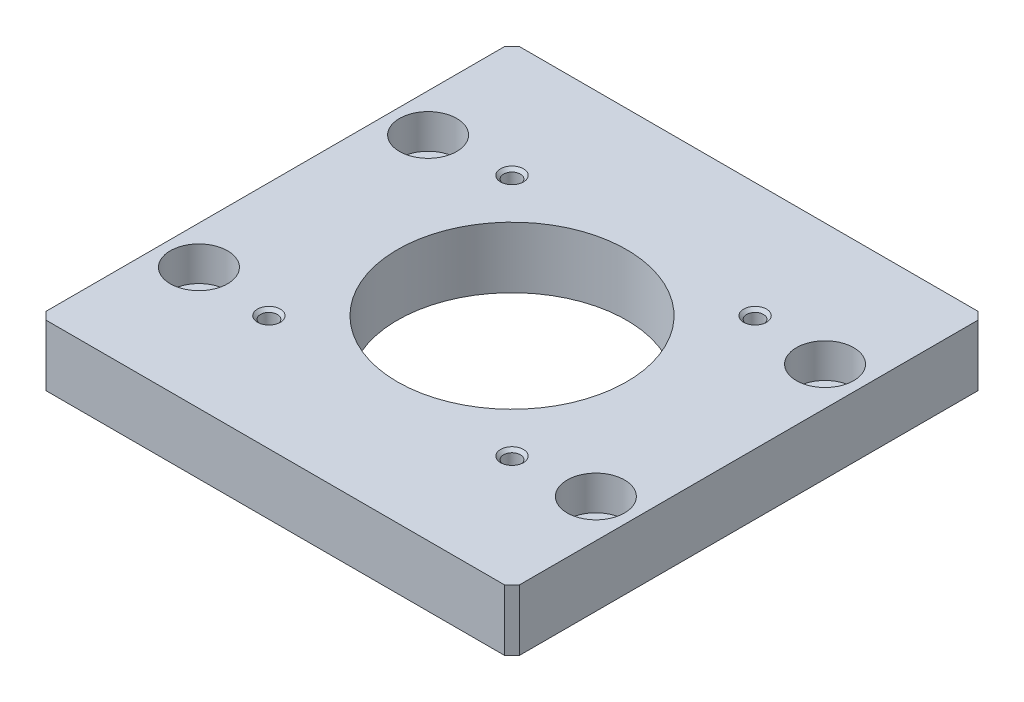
ISO-10303-21;
HEADER;
FILE_DESCRIPTION(('STEP AP214'),'2;1');
FILE_NAME('part.step','',(''),(''),'','','');
FILE_SCHEMA(('AUTOMOTIVE_DESIGN { 1 0 10303 214 1 1 1 1 }'));
ENDSEC;
DATA;
#1=APPLICATION_CONTEXT('core data for automotive mechanical design processes');
#2=APPLICATION_PROTOCOL_DEFINITION('international standard','automotive_design',2000,#1);
#3=PRODUCT_CONTEXT('',#1,'mechanical');
#4=PRODUCT('Part','Part','',(#3));
#5=PRODUCT_RELATED_PRODUCT_CATEGORY('part','',(#4));
#6=PRODUCT_DEFINITION_FORMATION('','',#4);
#7=PRODUCT_DEFINITION_CONTEXT('part definition',#1,'design');
#8=PRODUCT_DEFINITION('design','',#6,#7);
#9=PRODUCT_DEFINITION_SHAPE('','',#8);
#10=(LENGTH_UNIT() NAMED_UNIT(*) SI_UNIT(.MILLI.,.METRE.));
#11=(NAMED_UNIT(*) PLANE_ANGLE_UNIT() SI_UNIT($,.RADIAN.));
#12=(NAMED_UNIT(*) SI_UNIT($,.STERADIAN.) SOLID_ANGLE_UNIT());
#13=UNCERTAINTY_MEASURE_WITH_UNIT(LENGTH_MEASURE(1.E-05),#10,'distance_accuracy_value','');
#14=(GEOMETRIC_REPRESENTATION_CONTEXT(3) GLOBAL_UNCERTAINTY_ASSIGNED_CONTEXT((#13)) GLOBAL_UNIT_ASSIGNED_CONTEXT((#10,
#11,#12)) REPRESENTATION_CONTEXT('',''));
#15=CARTESIAN_POINT('',(0.,0.,0.));
#16=DIRECTION('',(0.,0.,1.));
#17=DIRECTION('',(1.,0.,0.));
#18=AXIS2_PLACEMENT_3D('',#15,#16,#17);
#19=CARTESIAN_POINT('',(-15.9099025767,7.60000000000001,-15.9099025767));
#20=DIRECTION('',(0.,1.,0.));
#21=DIRECTION('',(0.,0.,1.));
#22=AXIS2_PLACEMENT_3D('',#19,#20,#21);
#23=CONICAL_SURFACE('',#22,1.09999999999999,0.78539816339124);
#24=CARTESIAN_POINT('',(-15.9099025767,7.6,-15.9099025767));
#25=DIRECTION('',(0.,1.,0.));
#26=DIRECTION('',(1.,0.,0.));
#27=AXIS2_PLACEMENT_3D('',#24,#25,#26);
#28=CIRCLE('',#27,1.1);
#29=CARTESIAN_POINT('',(-14.8099025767,7.6,-15.9099025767));
#30=VERTEX_POINT('',#29);
#31=EDGE_CURVE('E191',#30,#30,#28,.F.);
#32=ORIENTED_EDGE('',*,*,#31,.T.);
#33=EDGE_LOOP('',(#32));
#34=FACE_BOUND('',#33,.T.);
#35=CARTESIAN_POINT('',(-15.9099025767,8.00000000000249,-15.9099025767));
#36=DIRECTION('',(0.,1.,0.));
#37=DIRECTION('',(0.,0.,1.));
#38=AXIS2_PLACEMENT_3D('',#35,#36,#37);
#39=CIRCLE('',#38,1.49999999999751);
#40=CARTESIAN_POINT('',(-15.9099025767,8.00000000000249,-14.4099025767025));
#41=VERTEX_POINT('',#40);
#42=EDGE_CURVE('E174',#41,#41,#39,.T.);
#43=ORIENTED_EDGE('',*,*,#42,.T.);
#44=EDGE_LOOP('',(#43));
#45=FACE_BOUND('',#44,.T.);
#46=ADVANCED_FACE('F16',(#34,#45),#23,.F.);
#47=CARTESIAN_POINT('',(15.9099025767,7.6,-15.9099025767));
#48=DIRECTION('',(0.,1.,0.));
#49=DIRECTION('',(-1.,0.,0.));
#50=AXIS2_PLACEMENT_3D('',#47,#48,#49);
#51=CONICAL_SURFACE('',#50,1.09999999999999,0.78539816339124);
#52=CARTESIAN_POINT('',(15.9099025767,7.6,-15.9099025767));
#53=DIRECTION('',(0.,1.,0.));
#54=DIRECTION('',(1.,0.,0.));
#55=AXIS2_PLACEMENT_3D('',#52,#53,#54);
#56=CIRCLE('',#55,1.1);
#57=CARTESIAN_POINT('',(17.0099025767,7.6,-15.9099025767));
#58=VERTEX_POINT('',#57);
#59=EDGE_CURVE('E195',#58,#58,#56,.F.);
#60=ORIENTED_EDGE('',*,*,#59,.T.);
#61=EDGE_LOOP('',(#60));
#62=FACE_BOUND('',#61,.T.);
#63=CARTESIAN_POINT('',(15.9099025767,8.00000000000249,-15.9099025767));
#64=DIRECTION('',(0.,1.,0.));
#65=DIRECTION('',(-1.,0.,0.));
#66=AXIS2_PLACEMENT_3D('',#63,#64,#65);
#67=CIRCLE('',#66,1.49999999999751);
#68=CARTESIAN_POINT('',(14.4099025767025,8.00000000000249,-15.9099025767));
#69=VERTEX_POINT('',#68);
#70=EDGE_CURVE('E171',#69,#69,#67,.T.);
#71=ORIENTED_EDGE('',*,*,#70,.T.);
#72=EDGE_LOOP('',(#71));
#73=FACE_BOUND('',#72,.T.);
#74=ADVANCED_FACE('F359',(#62,#73),#51,.F.);
#75=CARTESIAN_POINT('',(-15.9099025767,7.59999999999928,15.9099025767));
#76=DIRECTION('',(0.,1.,0.));
#77=DIRECTION('',(0.,0.,1.));
#78=AXIS2_PLACEMENT_3D('',#75,#76,#77);
#79=CONICAL_SURFACE('',#78,1.10000000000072,0.785398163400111);
#80=CARTESIAN_POINT('',(-15.9099025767,7.6,15.9099025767));
#81=DIRECTION('',(0.,1.,0.));
#82=DIRECTION('',(1.,0.,0.));
#83=AXIS2_PLACEMENT_3D('',#80,#81,#82);
#84=CIRCLE('',#83,1.1);
#85=CARTESIAN_POINT('',(-14.8099025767,7.6,15.9099025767));
#86=VERTEX_POINT('',#85);
#87=EDGE_CURVE('E208',#86,#86,#84,.F.);
#88=ORIENTED_EDGE('',*,*,#87,.T.);
#89=EDGE_LOOP('',(#88));
#90=FACE_BOUND('',#89,.T.);
#91=CARTESIAN_POINT('',(-15.9099025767,7.99999999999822,15.9099025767));
#92=DIRECTION('',(0.,1.,0.));
#93=DIRECTION('',(0.,0.,1.));
#94=AXIS2_PLACEMENT_3D('',#91,#92,#93);
#95=CIRCLE('',#94,1.50000000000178);
#96=CARTESIAN_POINT('',(-15.9099025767,7.99999999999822,17.4099025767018));
#97=VERTEX_POINT('',#96);
#98=EDGE_CURVE('E168',#97,#97,#95,.T.);
#99=ORIENTED_EDGE('',*,*,#98,.T.);
#100=EDGE_LOOP('',(#99));
#101=FACE_BOUND('',#100,.T.);
#102=ADVANCED_FACE('F355',(#90,#101),#79,.F.);
#103=CARTESIAN_POINT('',(15.9099025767,7.59999999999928,15.9099025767));
#104=DIRECTION('',(0.,1.,0.));
#105=DIRECTION('',(-1.,0.,0.));
#106=AXIS2_PLACEMENT_3D('',#103,#104,#105);
#107=CONICAL_SURFACE('',#106,1.10000000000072,0.785398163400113);
#108=CARTESIAN_POINT('',(15.9099025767,7.6,15.9099025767));
#109=DIRECTION('',(0.,1.,0.));
#110=DIRECTION('',(1.,0.,0.));
#111=AXIS2_PLACEMENT_3D('',#108,#109,#110);
#112=CIRCLE('',#111,1.1);
#113=CARTESIAN_POINT('',(17.0099025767,7.6,15.9099025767));
#114=VERTEX_POINT('',#113);
#115=EDGE_CURVE('E200',#114,#114,#112,.F.);
#116=ORIENTED_EDGE('',*,*,#115,.T.);
#117=EDGE_LOOP('',(#116));
#118=FACE_BOUND('',#117,.T.);
#119=CARTESIAN_POINT('',(15.9099025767,7.99999999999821,15.9099025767));
#120=DIRECTION('',(0.,1.,0.));
#121=DIRECTION('',(-1.,0.,0.));
#122=AXIS2_PLACEMENT_3D('',#119,#120,#121);
#123=CIRCLE('',#122,1.50000000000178);
#124=CARTESIAN_POINT('',(14.4099025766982,7.99999999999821,15.9099025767));
#125=VERTEX_POINT('',#124);
#126=EDGE_CURVE('E165',#125,#125,#123,.T.);
#127=ORIENTED_EDGE('',*,*,#126,.T.);
#128=EDGE_LOOP('',(#127));
#129=FACE_BOUND('',#128,.T.);
#130=ADVANCED_FACE('F352',(#118,#129),#107,.F.);
#131=CARTESIAN_POINT('',(25.98076211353,3.5,-15.));
#132=DIRECTION('',(0.,1.,0.));
#133=DIRECTION('',(0.,0.,1.));
#134=AXIS2_PLACEMENT_3D('',#131,#132,#133);
#135=CYLINDRICAL_SURFACE('',#134,3.75);
#136=CARTESIAN_POINT('',(25.98076211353,3.5,-15.));
#137=DIRECTION('',(0.,1.,0.));
#138=DIRECTION('',(0.,0.,1.));
#139=AXIS2_PLACEMENT_3D('',#136,#137,#138);
#140=CIRCLE('',#139,3.75);
#141=CARTESIAN_POINT('',(25.98076211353,3.5,-11.25));
#142=VERTEX_POINT('',#141);
#143=EDGE_CURVE('E20',#142,#142,#140,.F.);
#144=ORIENTED_EDGE('',*,*,#143,.T.);
#145=EDGE_LOOP('',(#144));
#146=FACE_BOUND('',#145,.T.);
#147=CARTESIAN_POINT('',(25.98076211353,8.,-15.));
#148=DIRECTION('',(0.,1.,0.));
#149=DIRECTION('',(0.,0.,1.));
#150=AXIS2_PLACEMENT_3D('',#147,#148,#149);
#151=CIRCLE('',#150,3.75);
#152=CARTESIAN_POINT('',(25.98076211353,8.,-11.25));
#153=VERTEX_POINT('',#152);
#154=EDGE_CURVE('E162',#153,#153,#151,.T.);
#155=ORIENTED_EDGE('',*,*,#154,.T.);
#156=EDGE_LOOP('',(#155));
#157=FACE_BOUND('',#156,.T.);
#158=ADVANCED_FACE('F348',(#146,#157),#135,.F.);
#159=CARTESIAN_POINT('',(-25.98076211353,3.5,-15.));
#160=DIRECTION('',(0.,1.,0.));
#161=DIRECTION('',(0.,0.,1.));
#162=AXIS2_PLACEMENT_3D('',#159,#160,#161);
#163=CYLINDRICAL_SURFACE('',#162,3.75);
#164=CARTESIAN_POINT('',(-25.98076211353,3.5,-15.));
#165=DIRECTION('',(0.,1.,0.));
#166=DIRECTION('',(0.,0.,1.));
#167=AXIS2_PLACEMENT_3D('',#164,#165,#166);
#168=CIRCLE('',#167,3.75);
#169=CARTESIAN_POINT('',(-25.98076211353,3.5,-11.25));
#170=VERTEX_POINT('',#169);
#171=EDGE_CURVE('E184',#170,#170,#168,.F.);
#172=ORIENTED_EDGE('',*,*,#171,.T.);
#173=EDGE_LOOP('',(#172));
#174=FACE_BOUND('',#173,.T.);
#175=CARTESIAN_POINT('',(-25.98076211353,8.,-15.));
#176=DIRECTION('',(0.,1.,0.));
#177=DIRECTION('',(0.,0.,1.));
#178=AXIS2_PLACEMENT_3D('',#175,#176,#177);
#179=CIRCLE('',#178,3.75);
#180=CARTESIAN_POINT('',(-25.98076211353,8.,-11.25));
#181=VERTEX_POINT('',#180);
#182=EDGE_CURVE('E159',#181,#181,#179,.T.);
#183=ORIENTED_EDGE('',*,*,#182,.T.);
#184=EDGE_LOOP('',(#183));
#185=FACE_BOUND('',#184,.T.);
#186=ADVANCED_FACE('F344',(#174,#185),#163,.F.);
#187=CARTESIAN_POINT('',(-25.98076211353,3.5,15.));
#188=DIRECTION('',(0.,1.,0.));
#189=DIRECTION('',(0.,0.,1.));
#190=AXIS2_PLACEMENT_3D('',#187,#188,#189);
#191=CYLINDRICAL_SURFACE('',#190,3.75);
#192=CARTESIAN_POINT('',(-25.98076211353,3.5,15.));
#193=DIRECTION('',(0.,1.,0.));
#194=DIRECTION('',(0.,0.,1.));
#195=AXIS2_PLACEMENT_3D('',#192,#193,#194);
#196=CIRCLE('',#195,3.75);
#197=CARTESIAN_POINT('',(-25.98076211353,3.5,18.75));
#198=VERTEX_POINT('',#197);
#199=EDGE_CURVE('E90',#198,#198,#196,.F.);
#200=ORIENTED_EDGE('',*,*,#199,.T.);
#201=EDGE_LOOP('',(#200));
#202=FACE_BOUND('',#201,.T.);
#203=CARTESIAN_POINT('',(-25.98076211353,8.,15.));
#204=DIRECTION('',(0.,1.,0.));
#205=DIRECTION('',(0.,0.,1.));
#206=AXIS2_PLACEMENT_3D('',#203,#204,#205);
#207=CIRCLE('',#206,3.75);
#208=CARTESIAN_POINT('',(-25.98076211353,8.,18.75));
#209=VERTEX_POINT('',#208);
#210=EDGE_CURVE('E107',#209,#209,#207,.T.);
#211=ORIENTED_EDGE('',*,*,#210,.T.);
#212=EDGE_LOOP('',(#211));
#213=FACE_BOUND('',#212,.T.);
#214=ADVANCED_FACE('F341',(#202,#213),#191,.F.);
#215=CARTESIAN_POINT('',(25.98076211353,3.5,15.));
#216=DIRECTION('',(0.,1.,0.));
#217=DIRECTION('',(0.,0.,1.));
#218=AXIS2_PLACEMENT_3D('',#215,#216,#217);
#219=CYLINDRICAL_SURFACE('',#218,3.75);
#220=CARTESIAN_POINT('',(25.98076211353,3.5,15.));
#221=DIRECTION('',(0.,1.,0.));
#222=DIRECTION('',(0.,0.,1.));
#223=AXIS2_PLACEMENT_3D('',#220,#221,#222);
#224=CIRCLE('',#223,3.75);
#225=CARTESIAN_POINT('',(25.98076211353,3.5,18.75));
#226=VERTEX_POINT('',#225);
#227=EDGE_CURVE('E186',#226,#226,#224,.F.);
#228=ORIENTED_EDGE('',*,*,#227,.T.);
#229=EDGE_LOOP('',(#228));
#230=FACE_BOUND('',#229,.T.);
#231=CARTESIAN_POINT('',(25.98076211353,8.,15.));
#232=DIRECTION('',(0.,1.,0.));
#233=DIRECTION('',(0.,0.,1.));
#234=AXIS2_PLACEMENT_3D('',#231,#232,#233);
#235=CIRCLE('',#234,3.75);
#236=CARTESIAN_POINT('',(25.98076211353,8.,18.75));
#237=VERTEX_POINT('',#236);
#238=EDGE_CURVE('E104',#237,#237,#235,.T.);
#239=ORIENTED_EDGE('',*,*,#238,.T.);
#240=EDGE_LOOP('',(#239));
#241=FACE_BOUND('',#240,.T.);
#242=ADVANCED_FACE('F338',(#230,#241),#219,.F.);
#243=CARTESIAN_POINT('',(-31.08184,8.16,-29.91816));
#244=DIRECTION('',(-0.707106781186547,0.,-0.707106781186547));
#245=DIRECTION('',(0.707106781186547,0.,-0.707106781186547));
#246=AXIS2_PLACEMENT_3D('',#243,#244,#245);
#247=PLANE('',#246);
#248=DIRECTION('',(0.707106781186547,0.,-0.707106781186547));
#249=VECTOR('',#248,1.);
#250=CARTESIAN_POINT('',(-31.08184,8.,-29.91816));
#251=LINE('',#250,#249);
#252=CARTESIAN_POINT('',(-31.,8.,-30.));
#253=VERTEX_POINT('',#252);
#254=CARTESIAN_POINT('',(-30.,8.,-31.));
#255=VERTEX_POINT('',#254);
#256=EDGE_CURVE('E177',#253,#255,#251,.T.);
#257=ORIENTED_EDGE('',*,*,#256,.T.);
#258=DIRECTION('',(0.,1.,0.));
#259=VECTOR('',#258,1.);
#260=CARTESIAN_POINT('',(-30.,4.,-31.));
#261=LINE('',#260,#259);
#262=CARTESIAN_POINT('',(-30.,0.,-31.));
#263=VERTEX_POINT('',#262);
#264=EDGE_CURVE('E100',#255,#263,#261,.F.);
#265=ORIENTED_EDGE('',*,*,#264,.T.);
#266=DIRECTION('',(-0.707106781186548,0.,0.707106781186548));
#267=VECTOR('',#266,1.);
#268=CARTESIAN_POINT('',(-30.5,0.,-30.5));
#269=LINE('',#268,#267);
#270=CARTESIAN_POINT('',(-31.,0.,-30.));
#271=VERTEX_POINT('',#270);
#272=EDGE_CURVE('E203',#271,#263,#269,.F.);
#273=ORIENTED_EDGE('',*,*,#272,.F.);
#274=DIRECTION('',(0.,-1.,0.));
#275=VECTOR('',#274,1.);
#276=CARTESIAN_POINT('',(-31.,4.,-30.));
#277=LINE('',#276,#275);
#278=EDGE_CURVE('E215',#271,#253,#277,.F.);
#279=ORIENTED_EDGE('',*,*,#278,.T.);
#280=EDGE_LOOP('',(#257,#265,#273,#279));
#281=FACE_BOUND('',#280,.T.);
#282=ADVANCED_FACE('F261',(#281),#247,.T.);
#283=CARTESIAN_POINT('',(-29.91816,8.16,31.08184));
#284=DIRECTION('',(-0.707106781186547,0.,0.707106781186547));
#285=DIRECTION('',(-0.707106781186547,0.,-0.707106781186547));
#286=AXIS2_PLACEMENT_3D('',#283,#284,#285);
#287=PLANE('',#286);
#288=DIRECTION('',(-0.707106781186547,0.,-0.707106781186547));
#289=VECTOR('',#288,1.);
#290=CARTESIAN_POINT('',(-29.91816,8.,31.08184));
#291=LINE('',#290,#289);
#292=CARTESIAN_POINT('',(-30.,8.,31.));
#293=VERTEX_POINT('',#292);
#294=CARTESIAN_POINT('',(-31.,8.,30.));
#295=VERTEX_POINT('',#294);
#296=EDGE_CURVE('E179',#293,#295,#291,.T.);
#297=ORIENTED_EDGE('',*,*,#296,.T.);
#298=DIRECTION('',(0.,1.,0.));
#299=VECTOR('',#298,1.);
#300=CARTESIAN_POINT('',(-31.,4.,30.));
#301=LINE('',#300,#299);
#302=CARTESIAN_POINT('',(-31.,0.,30.));
#303=VERTEX_POINT('',#302);
#304=EDGE_CURVE('E214',#295,#303,#301,.F.);
#305=ORIENTED_EDGE('',*,*,#304,.T.);
#306=DIRECTION('',(0.707106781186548,0.,0.707106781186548));
#307=VECTOR('',#306,1.);
#308=CARTESIAN_POINT('',(-30.5,0.,30.5));
#309=LINE('',#308,#307);
#310=CARTESIAN_POINT('',(-30.,0.,31.));
#311=VERTEX_POINT('',#310);
#312=EDGE_CURVE('E257',#311,#303,#309,.F.);
#313=ORIENTED_EDGE('',*,*,#312,.F.);
#314=DIRECTION('',(0.,-1.,0.));
#315=VECTOR('',#314,1.);
#316=CARTESIAN_POINT('',(-30.,4.,31.));
#317=LINE('',#316,#315);
#318=EDGE_CURVE('E222',#311,#293,#317,.F.);
#319=ORIENTED_EDGE('',*,*,#318,.T.);
#320=EDGE_LOOP('',(#297,#305,#313,#319));
#321=FACE_BOUND('',#320,.T.);
#322=ADVANCED_FACE('F267',(#321),#287,.T.);
#323=CARTESIAN_POINT('',(29.91816,8.16,-31.08184));
#324=DIRECTION('',(0.707106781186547,0.,-0.707106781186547));
#325=DIRECTION('',(0.707106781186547,0.,0.707106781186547));
#326=AXIS2_PLACEMENT_3D('',#323,#324,#325);
#327=PLANE('',#326);
#328=DIRECTION('',(0.707106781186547,0.,0.707106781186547));
#329=VECTOR('',#328,1.);
#330=CARTESIAN_POINT('',(29.91816,8.,-31.08184));
#331=LINE('',#330,#329);
#332=CARTESIAN_POINT('',(30.,8.,-31.));
#333=VERTEX_POINT('',#332);
#334=CARTESIAN_POINT('',(31.,8.,-30.));
#335=VERTEX_POINT('',#334);
#336=EDGE_CURVE('E80',#333,#335,#331,.T.);
#337=ORIENTED_EDGE('',*,*,#336,.T.);
#338=DIRECTION('',(0.,1.,0.));
#339=VECTOR('',#338,1.);
#340=CARTESIAN_POINT('',(31.,4.,-30.));
#341=LINE('',#340,#339);
#342=CARTESIAN_POINT('',(31.,0.,-30.));
#343=VERTEX_POINT('',#342);
#344=EDGE_CURVE('E113',#335,#343,#341,.F.);
#345=ORIENTED_EDGE('',*,*,#344,.T.);
#346=DIRECTION('',(-0.707106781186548,0.,-0.707106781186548));
#347=VECTOR('',#346,1.);
#348=CARTESIAN_POINT('',(30.5,0.,-30.5));
#349=LINE('',#348,#347);
#350=CARTESIAN_POINT('',(30.,0.,-31.));
#351=VERTEX_POINT('',#350);
#352=EDGE_CURVE('E103',#351,#343,#349,.F.);
#353=ORIENTED_EDGE('',*,*,#352,.F.);
#354=DIRECTION('',(0.,-1.,0.));
#355=VECTOR('',#354,1.);
#356=CARTESIAN_POINT('',(30.,4.,-31.));
#357=LINE('',#356,#355);
#358=EDGE_CURVE('E97',#351,#333,#357,.F.);
#359=ORIENTED_EDGE('',*,*,#358,.T.);
#360=EDGE_LOOP('',(#337,#345,#353,#359));
#361=FACE_BOUND('',#360,.T.);
#362=ADVANCED_FACE('F102',(#361),#327,.T.);
#363=CARTESIAN_POINT('',(31.08184,8.16,29.91816));
#364=DIRECTION('',(0.707106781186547,0.,0.707106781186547));
#365=DIRECTION('',(-0.707106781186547,0.,0.707106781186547));
#366=AXIS2_PLACEMENT_3D('',#363,#364,#365);
#367=PLANE('',#366);
#368=DIRECTION('',(-0.707106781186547,0.,0.707106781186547));
#369=VECTOR('',#368,1.);
#370=CARTESIAN_POINT('',(31.08184,8.,29.91816));
#371=LINE('',#370,#369);
#372=CARTESIAN_POINT('',(31.,8.,30.));
#373=VERTEX_POINT('',#372);
#374=CARTESIAN_POINT('',(30.,8.,31.));
#375=VERTEX_POINT('',#374);
#376=EDGE_CURVE('E89',#373,#375,#371,.T.);
#377=ORIENTED_EDGE('',*,*,#376,.T.);
#378=DIRECTION('',(0.,1.,0.));
#379=VECTOR('',#378,1.);
#380=CARTESIAN_POINT('',(30.,4.,31.));
#381=LINE('',#380,#379);
#382=CARTESIAN_POINT('',(30.,0.,31.));
#383=VERTEX_POINT('',#382);
#384=EDGE_CURVE('E111',#375,#383,#381,.F.);
#385=ORIENTED_EDGE('',*,*,#384,.T.);
#386=DIRECTION('',(0.707106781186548,0.,-0.707106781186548));
#387=VECTOR('',#386,1.);
#388=CARTESIAN_POINT('',(30.5,0.,30.5));
#389=LINE('',#388,#387);
#390=CARTESIAN_POINT('',(31.,0.,30.));
#391=VERTEX_POINT('',#390);
#392=EDGE_CURVE('E35',#391,#383,#389,.F.);
#393=ORIENTED_EDGE('',*,*,#392,.F.);
#394=DIRECTION('',(0.,-1.,0.));
#395=VECTOR('',#394,1.);
#396=CARTESIAN_POINT('',(31.,4.,30.));
#397=LINE('',#396,#395);
#398=EDGE_CURVE('E114',#391,#373,#397,.F.);
#399=ORIENTED_EDGE('',*,*,#398,.T.);
#400=EDGE_LOOP('',(#377,#385,#393,#399));
#401=FACE_BOUND('',#400,.T.);
#402=ADVANCED_FACE('F228',(#401),#367,.T.);
#403=CARTESIAN_POINT('',(-15.9099025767,0.4,15.9099025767));
#404=DIRECTION('',(0.,1.,0.));
#405=DIRECTION('',(0.,0.,1.));
#406=AXIS2_PLACEMENT_3D('',#403,#404,#405);
#407=CYLINDRICAL_SURFACE('',#406,1.1);
#408=CARTESIAN_POINT('',(-15.9099025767,0.400000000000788,15.9099025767));
#409=DIRECTION('',(0.,-1.,0.));
#410=DIRECTION('',(0.,0.,-1.));
#411=AXIS2_PLACEMENT_3D('',#408,#409,#410);
#412=CIRCLE('',#411,1.10000000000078);
#413=CARTESIAN_POINT('',(-15.9099025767,0.400000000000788,14.8099025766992));
#414=VERTEX_POINT('',#413);
#415=EDGE_CURVE('E227',#414,#414,#412,.T.);
#416=ORIENTED_EDGE('',*,*,#415,.T.);
#417=EDGE_LOOP('',(#416));
#418=FACE_BOUND('',#417,.T.);
#419=ORIENTED_EDGE('',*,*,#87,.F.);
#420=EDGE_LOOP('',(#419));
#421=FACE_BOUND('',#420,.T.);
#422=ADVANCED_FACE('F333',(#418,#421),#407,.F.);
#423=CARTESIAN_POINT('',(15.9099025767,0.4,15.9099025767));
#424=DIRECTION('',(0.,1.,0.));
#425=DIRECTION('',(0.,0.,1.));
#426=AXIS2_PLACEMENT_3D('',#423,#424,#425);
#427=CYLINDRICAL_SURFACE('',#426,1.1);
#428=CARTESIAN_POINT('',(15.9099025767,0.400000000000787,15.9099025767));
#429=DIRECTION('',(0.,-1.,0.));
#430=DIRECTION('',(0.,0.,-1.));
#431=AXIS2_PLACEMENT_3D('',#428,#429,#430);
#432=CIRCLE('',#431,1.10000000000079);
#433=CARTESIAN_POINT('',(15.9099025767,0.400000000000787,14.8099025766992));
#434=VERTEX_POINT('',#433);
#435=EDGE_CURVE('E251',#434,#434,#432,.T.);
#436=ORIENTED_EDGE('',*,*,#435,.T.);
#437=EDGE_LOOP('',(#436));
#438=FACE_BOUND('',#437,.T.);
#439=ORIENTED_EDGE('',*,*,#115,.F.);
#440=EDGE_LOOP('',(#439));
#441=FACE_BOUND('',#440,.T.);
#442=ADVANCED_FACE('F329',(#438,#441),#427,.F.);
#443=CARTESIAN_POINT('',(15.9099025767,0.4,-15.9099025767));
#444=DIRECTION('',(0.,1.,0.));
#445=DIRECTION('',(0.,0.,1.));
#446=AXIS2_PLACEMENT_3D('',#443,#444,#445);
#447=CYLINDRICAL_SURFACE('',#446,1.1);
#448=CARTESIAN_POINT('',(15.9099025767,0.400000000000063,-15.9099025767));
#449=DIRECTION('',(0.,-1.,0.));
#450=DIRECTION('',(0.,0.,-1.));
#451=AXIS2_PLACEMENT_3D('',#448,#449,#450);
#452=CIRCLE('',#451,1.10000000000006);
#453=CARTESIAN_POINT('',(15.9099025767,0.400000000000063,-17.0099025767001));
#454=VERTEX_POINT('',#453);
#455=EDGE_CURVE('E248',#454,#454,#452,.T.);
#456=ORIENTED_EDGE('',*,*,#455,.T.);
#457=EDGE_LOOP('',(#456));
#458=FACE_BOUND('',#457,.T.);
#459=ORIENTED_EDGE('',*,*,#59,.F.);
#460=EDGE_LOOP('',(#459));
#461=FACE_BOUND('',#460,.T.);
#462=ADVANCED_FACE('F325',(#458,#461),#447,.F.);
#463=CARTESIAN_POINT('',(-15.9099025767,0.4,-15.9099025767));
#464=DIRECTION('',(0.,1.,0.));
#465=DIRECTION('',(0.,0.,1.));
#466=AXIS2_PLACEMENT_3D('',#463,#464,#465);
#467=CYLINDRICAL_SURFACE('',#466,1.1);
#468=CARTESIAN_POINT('',(-15.9099025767,0.400000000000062,-15.9099025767));
#469=DIRECTION('',(0.,-1.,0.));
#470=DIRECTION('',(0.,0.,-1.));
#471=AXIS2_PLACEMENT_3D('',#468,#469,#470);
#472=CIRCLE('',#471,1.10000000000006);
#473=CARTESIAN_POINT('',(-15.9099025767,0.400000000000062,-17.0099025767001));
#474=VERTEX_POINT('',#473);
#475=EDGE_CURVE('E155',#474,#474,#472,.T.);
#476=ORIENTED_EDGE('',*,*,#475,.T.);
#477=EDGE_LOOP('',(#476));
#478=FACE_BOUND('',#477,.T.);
#479=ORIENTED_EDGE('',*,*,#31,.F.);
#480=EDGE_LOOP('',(#479));
#481=FACE_BOUND('',#480,.T.);
#482=ADVANCED_FACE('F321',(#478,#481),#467,.F.);
#483=CARTESIAN_POINT('',(-30.91999259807,3.5,19.50812731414));
#484=DIRECTION('',(0.,1.,0.));
#485=DIRECTION('',(1.,0.,0.));
#486=AXIS2_PLACEMENT_3D('',#483,#484,#485);
#487=PLANE('',#486);
#488=CARTESIAN_POINT('',(25.98076211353,3.5,-15.));
#489=DIRECTION('',(0.,1.,0.));
#490=DIRECTION('',(0.,0.,1.));
#491=AXIS2_PLACEMENT_3D('',#488,#489,#490);
#492=CIRCLE('',#491,2.25);
#493=CARTESIAN_POINT('',(25.98076211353,3.5,-12.75));
#494=VERTEX_POINT('',#493);
#495=EDGE_CURVE('E153',#494,#494,#492,.F.);
#496=ORIENTED_EDGE('',*,*,#495,.T.);
#497=EDGE_LOOP('',(#496));
#498=FACE_BOUND('',#497,.T.);
#499=ORIENTED_EDGE('',*,*,#143,.F.);
#500=EDGE_LOOP('',(#499));
#501=FACE_BOUND('',#500,.T.);
#502=ADVANCED_FACE('F324',(#498,#501),#487,.T.);
#503=CARTESIAN_POINT('',(-30.91999259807,3.5,19.50812731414));
#504=DIRECTION('',(0.,1.,0.));
#505=DIRECTION('',(1.,0.,0.));
#506=AXIS2_PLACEMENT_3D('',#503,#504,#505);
#507=PLANE('',#506);
#508=CARTESIAN_POINT('',(25.98076211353,3.5,15.));
#509=DIRECTION('',(0.,1.,0.));
#510=DIRECTION('',(0.,0.,1.));
#511=AXIS2_PLACEMENT_3D('',#508,#509,#510);
#512=CIRCLE('',#511,2.25);
#513=CARTESIAN_POINT('',(25.98076211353,3.5,17.25));
#514=VERTEX_POINT('',#513);
#515=EDGE_CURVE('E150',#514,#514,#512,.F.);
#516=ORIENTED_EDGE('',*,*,#515,.T.);
#517=EDGE_LOOP('',(#516));
#518=FACE_BOUND('',#517,.T.);
#519=ORIENTED_EDGE('',*,*,#227,.F.);
#520=EDGE_LOOP('',(#519));
#521=FACE_BOUND('',#520,.T.);
#522=ADVANCED_FACE('F376',(#518,#521),#507,.T.);
#523=CARTESIAN_POINT('',(-30.91999259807,3.5,19.50812731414));
#524=DIRECTION('',(0.,1.,0.));
#525=DIRECTION('',(1.,0.,0.));
#526=AXIS2_PLACEMENT_3D('',#523,#524,#525);
#527=PLANE('',#526);
#528=CARTESIAN_POINT('',(-25.98076211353,3.5,-15.));
#529=DIRECTION('',(0.,1.,0.));
#530=DIRECTION('',(0.,0.,1.));
#531=AXIS2_PLACEMENT_3D('',#528,#529,#530);
#532=CIRCLE('',#531,2.25);
#533=CARTESIAN_POINT('',(-25.98076211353,3.5,-12.75));
#534=VERTEX_POINT('',#533);
#535=EDGE_CURVE('E147',#534,#534,#532,.F.);
#536=ORIENTED_EDGE('',*,*,#535,.T.);
#537=EDGE_LOOP('',(#536));
#538=FACE_BOUND('',#537,.T.);
#539=ORIENTED_EDGE('',*,*,#171,.F.);
#540=EDGE_LOOP('',(#539));
#541=FACE_BOUND('',#540,.T.);
#542=ADVANCED_FACE('F380',(#538,#541),#527,.T.);
#543=CARTESIAN_POINT('',(-30.91999259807,3.5,19.50812731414));
#544=DIRECTION('',(0.,1.,0.));
#545=DIRECTION('',(1.,0.,0.));
#546=AXIS2_PLACEMENT_3D('',#543,#544,#545);
#547=PLANE('',#546);
#548=CARTESIAN_POINT('',(-25.98076211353,3.5,15.));
#549=DIRECTION('',(0.,1.,0.));
#550=DIRECTION('',(0.,0.,1.));
#551=AXIS2_PLACEMENT_3D('',#548,#549,#550);
#552=CIRCLE('',#551,2.25);
#553=CARTESIAN_POINT('',(-25.98076211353,3.5,17.25));
#554=VERTEX_POINT('',#553);
#555=EDGE_CURVE('E144',#554,#554,#552,.F.);
#556=ORIENTED_EDGE('',*,*,#555,.T.);
#557=EDGE_LOOP('',(#556));
#558=FACE_BOUND('',#557,.T.);
#559=ORIENTED_EDGE('',*,*,#199,.F.);
#560=EDGE_LOOP('',(#559));
#561=FACE_BOUND('',#560,.T.);
#562=ADVANCED_FACE('F384',(#558,#561),#547,.T.);
#563=CARTESIAN_POINT('',(-32.24,8.,32.24));
#564=DIRECTION('',(0.,1.,0.));
#565=DIRECTION('',(1.,0.,0.));
#566=AXIS2_PLACEMENT_3D('',#563,#564,#565);
#567=PLANE('',#566);
#568=CARTESIAN_POINT('',(0.,8.,0.));
#569=DIRECTION('',(0.,1.,0.));
#570=DIRECTION('',(0.,0.,1.));
#571=AXIS2_PLACEMENT_3D('',#568,#569,#570);
#572=CIRCLE('',#571,15.);
#573=CARTESIAN_POINT('',(0.,8.,15.));
#574=VERTEX_POINT('',#573);
#575=EDGE_CURVE('E140',#574,#574,#572,.F.);
#576=ORIENTED_EDGE('',*,*,#575,.T.);
#577=EDGE_LOOP('',(#576));
#578=FACE_BOUND('',#577,.T.);
#579=ORIENTED_EDGE('',*,*,#238,.F.);
#580=EDGE_LOOP('',(#579));
#581=FACE_BOUND('',#580,.T.);
#582=ORIENTED_EDGE('',*,*,#210,.F.);
#583=EDGE_LOOP('',(#582));
#584=FACE_BOUND('',#583,.T.);
#585=ORIENTED_EDGE('',*,*,#182,.F.);
#586=EDGE_LOOP('',(#585));
#587=FACE_BOUND('',#586,.T.);
#588=ORIENTED_EDGE('',*,*,#154,.F.);
#589=EDGE_LOOP('',(#588));
#590=FACE_BOUND('',#589,.T.);
#591=ORIENTED_EDGE('',*,*,#126,.F.);
#592=EDGE_LOOP('',(#591));
#593=FACE_BOUND('',#592,.T.);
#594=ORIENTED_EDGE('',*,*,#98,.F.);
#595=EDGE_LOOP('',(#594));
#596=FACE_BOUND('',#595,.T.);
#597=ORIENTED_EDGE('',*,*,#70,.F.);
#598=EDGE_LOOP('',(#597));
#599=FACE_BOUND('',#598,.T.);
#600=ORIENTED_EDGE('',*,*,#42,.F.);
#601=EDGE_LOOP('',(#600));
#602=FACE_BOUND('',#601,.T.);
#603=ORIENTED_EDGE('',*,*,#256,.F.);
#604=DIRECTION('',(0.,0.,-1.));
#605=VECTOR('',#604,1.);
#606=CARTESIAN_POINT('',(-31.,8.,0.));
#607=LINE('',#606,#605);
#608=EDGE_CURVE('E211',#253,#295,#607,.F.);
#609=ORIENTED_EDGE('',*,*,#608,.T.);
#610=ORIENTED_EDGE('',*,*,#296,.F.);
#611=DIRECTION('',(-1.,0.,0.));
#612=VECTOR('',#611,1.);
#613=CARTESIAN_POINT('',(0.,8.,31.));
#614=LINE('',#613,#612);
#615=EDGE_CURVE('E219',#293,#375,#614,.F.);
#616=ORIENTED_EDGE('',*,*,#615,.T.);
#617=ORIENTED_EDGE('',*,*,#376,.F.);
#618=DIRECTION('',(0.,0.,1.));
#619=VECTOR('',#618,1.);
#620=CARTESIAN_POINT('',(31.,8.,0.));
#621=LINE('',#620,#619);
#622=EDGE_CURVE('E85',#373,#335,#621,.F.);
#623=ORIENTED_EDGE('',*,*,#622,.T.);
#624=ORIENTED_EDGE('',*,*,#336,.F.);
#625=DIRECTION('',(1.,0.,0.));
#626=VECTOR('',#625,1.);
#627=CARTESIAN_POINT('',(0.,8.,-31.));
#628=LINE('',#627,#626);
#629=EDGE_CURVE('E83',#333,#255,#628,.F.);
#630=ORIENTED_EDGE('',*,*,#629,.T.);
#631=EDGE_LOOP('',(#603,#609,#610,#616,#617,#623,#624,#630));
#632=FACE_BOUND('',#631,.T.);
#633=ADVANCED_FACE('F82',(#578,#581,#584,#587,#590,#593,#596,#599,#602,#632),#567,.T.);
#634=CARTESIAN_POINT('',(31.2,-0.16,-31.));
#635=DIRECTION('',(0.,0.,-1.));
#636=DIRECTION('',(-1.,0.,0.));
#637=AXIS2_PLACEMENT_3D('',#634,#635,#636);
#638=PLANE('',#637);
#639=ORIENTED_EDGE('',*,*,#264,.F.);
#640=ORIENTED_EDGE('',*,*,#629,.F.);
#641=ORIENTED_EDGE('',*,*,#358,.F.);
#642=DIRECTION('',(-1.,0.,0.));
#643=VECTOR('',#642,1.);
#644=CARTESIAN_POINT('',(0.,0.,-31.));
#645=LINE('',#644,#643);
#646=EDGE_CURVE('E143',#351,#263,#645,.T.);
#647=ORIENTED_EDGE('',*,*,#646,.T.);
#648=EDGE_LOOP('',(#639,#640,#641,#647));
#649=FACE_BOUND('',#648,.T.);
#650=ADVANCED_FACE('F95',(#649),#638,.T.);
#651=CARTESIAN_POINT('',(-31.,-0.16,-31.2));
#652=DIRECTION('',(-1.,0.,0.));
#653=DIRECTION('',(0.,0.,1.));
#654=AXIS2_PLACEMENT_3D('',#651,#652,#653);
#655=PLANE('',#654);
#656=ORIENTED_EDGE('',*,*,#304,.F.);
#657=ORIENTED_EDGE('',*,*,#608,.F.);
#658=ORIENTED_EDGE('',*,*,#278,.F.);
#659=DIRECTION('',(0.,0.,1.));
#660=VECTOR('',#659,1.);
#661=CARTESIAN_POINT('',(-31.,0.,0.));
#662=LINE('',#661,#660);
#663=EDGE_CURVE('E240',#271,#303,#662,.T.);
#664=ORIENTED_EDGE('',*,*,#663,.T.);
#665=EDGE_LOOP('',(#656,#657,#658,#664));
#666=FACE_BOUND('',#665,.T.);
#667=ADVANCED_FACE('F265',(#666),#655,.T.);
#668=CARTESIAN_POINT('',(-31.2,-0.16,31.));
#669=DIRECTION('',(0.,0.,1.));
#670=DIRECTION('',(1.,0.,0.));
#671=AXIS2_PLACEMENT_3D('',#668,#669,#670);
#672=PLANE('',#671);
#673=ORIENTED_EDGE('',*,*,#384,.F.);
#674=ORIENTED_EDGE('',*,*,#615,.F.);
#675=ORIENTED_EDGE('',*,*,#318,.F.);
#676=DIRECTION('',(1.,0.,0.));
#677=VECTOR('',#676,1.);
#678=CARTESIAN_POINT('',(0.,0.,31.));
#679=LINE('',#678,#677);
#680=EDGE_CURVE('E237',#311,#383,#679,.T.);
#681=ORIENTED_EDGE('',*,*,#680,.T.);
#682=EDGE_LOOP('',(#673,#674,#675,#681));
#683=FACE_BOUND('',#682,.T.);
#684=ADVANCED_FACE('F271',(#683),#672,.T.);
#685=CARTESIAN_POINT('',(31.,-0.16,31.2));
#686=DIRECTION('',(1.,0.,0.));
#687=DIRECTION('',(0.,0.,-1.));
#688=AXIS2_PLACEMENT_3D('',#685,#686,#687);
#689=PLANE('',#688);
#690=ORIENTED_EDGE('',*,*,#398,.F.);
#691=DIRECTION('',(0.,0.,-1.));
#692=VECTOR('',#691,1.);
#693=CARTESIAN_POINT('',(31.,0.,0.));
#694=LINE('',#693,#692);
#695=EDGE_CURVE('E139',#391,#343,#694,.T.);
#696=ORIENTED_EDGE('',*,*,#695,.T.);
#697=ORIENTED_EDGE('',*,*,#344,.F.);
#698=ORIENTED_EDGE('',*,*,#622,.F.);
#699=EDGE_LOOP('',(#690,#696,#697,#698));
#700=FACE_BOUND('',#699,.T.);
#701=ADVANCED_FACE('F233',(#700),#689,.T.);
#702=CARTESIAN_POINT('',(-15.9099025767,0.400000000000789,15.9099025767));
#703=DIRECTION('',(0.,-1.,0.));
#704=DIRECTION('',(1.,0.,0.));
#705=AXIS2_PLACEMENT_3D('',#702,#703,#704);
#706=CONICAL_SURFACE('',#705,1.10000000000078,0.785398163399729);
#707=ORIENTED_EDGE('',*,*,#415,.F.);
#708=EDGE_LOOP('',(#707));
#709=FACE_BOUND('',#708,.T.);
#710=CARTESIAN_POINT('',(-15.9099025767,1.69748113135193E-12,15.9099025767));
#711=DIRECTION('',(0.,-1.,0.));
#712=DIRECTION('',(0.,0.,-1.));
#713=AXIS2_PLACEMENT_3D('',#710,#711,#712);
#714=CIRCLE('',#713,1.5000000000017);
#715=CARTESIAN_POINT('',(-15.9099025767,1.69748113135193E-12,14.4099025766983));
#716=VERTEX_POINT('',#715);
#717=EDGE_CURVE('E136',#716,#716,#714,.T.);
#718=ORIENTED_EDGE('',*,*,#717,.T.);
#719=EDGE_LOOP('',(#718));
#720=FACE_BOUND('',#719,.T.);
#721=ADVANCED_FACE('F279',(#709,#720),#706,.F.);
#722=CARTESIAN_POINT('',(15.9099025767,0.40000000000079,15.9099025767));
#723=DIRECTION('',(0.,-1.,0.));
#724=DIRECTION('',(0.,0.,-1.));
#725=AXIS2_PLACEMENT_3D('',#722,#723,#724);
#726=CONICAL_SURFACE('',#725,1.10000000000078,0.78539816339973);
#727=ORIENTED_EDGE('',*,*,#435,.F.);
#728=EDGE_LOOP('',(#727));
#729=FACE_BOUND('',#728,.T.);
#730=CARTESIAN_POINT('',(15.9099025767,1.69970374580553E-12,15.9099025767));
#731=DIRECTION('',(0.,-1.,0.));
#732=DIRECTION('',(1.,0.,0.));
#733=AXIS2_PLACEMENT_3D('',#730,#731,#732);
#734=CIRCLE('',#733,1.5000000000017);
#735=CARTESIAN_POINT('',(17.4099025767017,1.69966678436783E-12,15.9099025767));
#736=VERTEX_POINT('',#735);
#737=EDGE_CURVE('E133',#736,#736,#734,.T.);
#738=ORIENTED_EDGE('',*,*,#737,.T.);
#739=EDGE_LOOP('',(#738));
#740=FACE_BOUND('',#739,.T.);
#741=ADVANCED_FACE('F309',(#729,#740),#726,.F.);
#742=CARTESIAN_POINT('',(15.9099025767,0.400000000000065,-15.9099025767));
#743=DIRECTION('',(0.,-1.,0.));
#744=DIRECTION('',(1.,0.,0.));
#745=AXIS2_PLACEMENT_3D('',#742,#743,#744);
#746=CONICAL_SURFACE('',#745,1.10000000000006,0.78539816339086);
#747=ORIENTED_EDGE('',*,*,#455,.F.);
#748=EDGE_LOOP('',(#747));
#749=FACE_BOUND('',#748,.T.);
#750=CARTESIAN_POINT('',(15.9099025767,-2.57498015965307E-12,-15.9099025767));
#751=DIRECTION('',(0.,-1.,0.));
#752=DIRECTION('',(0.,0.,-1.));
#753=AXIS2_PLACEMENT_3D('',#750,#751,#752);
#754=CIRCLE('',#753,1.49999999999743);
#755=CARTESIAN_POINT('',(15.9099025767,-2.57498015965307E-12,-17.4099025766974));
#756=VERTEX_POINT('',#755);
#757=EDGE_CURVE('E130',#756,#756,#754,.T.);
#758=ORIENTED_EDGE('',*,*,#757,.T.);
#759=EDGE_LOOP('',(#758));
#760=FACE_BOUND('',#759,.T.);
#761=ADVANCED_FACE('F315',(#749,#760),#746,.F.);
#762=CARTESIAN_POINT('',(-15.9099025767,0.400000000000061,-15.9099025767));
#763=DIRECTION('',(0.,-1.,0.));
#764=DIRECTION('',(1.,0.,0.));
#765=AXIS2_PLACEMENT_3D('',#762,#763,#764);
#766=CONICAL_SURFACE('',#765,1.10000000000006,0.785398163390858);
#767=ORIENTED_EDGE('',*,*,#475,.F.);
#768=EDGE_LOOP('',(#767));
#769=FACE_BOUND('',#768,.T.);
#770=CARTESIAN_POINT('',(-15.9099025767,-2.57411279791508E-12,-15.9099025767));
#771=DIRECTION('',(0.,-1.,0.));
#772=DIRECTION('',(0.,0.,-1.));
#773=AXIS2_PLACEMENT_3D('',#770,#771,#772);
#774=CIRCLE('',#773,1.49999999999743);
#775=CARTESIAN_POINT('',(-15.9099025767,-2.57411279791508E-12,-17.4099025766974));
#776=VERTEX_POINT('',#775);
#777=EDGE_CURVE('E127',#776,#776,#774,.T.);
#778=ORIENTED_EDGE('',*,*,#777,.T.);
#779=EDGE_LOOP('',(#778));
#780=FACE_BOUND('',#779,.T.);
#781=ADVANCED_FACE('F435',(#769,#780),#766,.F.);
#782=CARTESIAN_POINT('',(25.98076211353,0.,-15.));
#783=DIRECTION('',(0.,1.,0.));
#784=DIRECTION('',(0.,0.,1.));
#785=AXIS2_PLACEMENT_3D('',#782,#783,#784);
#786=CYLINDRICAL_SURFACE('',#785,2.25);
#787=CARTESIAN_POINT('',(25.98076211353,0.,-15.));
#788=DIRECTION('',(0.,1.,0.));
#789=DIRECTION('',(0.,0.,1.));
#790=AXIS2_PLACEMENT_3D('',#787,#788,#789);
#791=CIRCLE('',#790,2.25);
#792=CARTESIAN_POINT('',(25.98076211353,0.,-12.75));
#793=VERTEX_POINT('',#792);
#794=EDGE_CURVE('E124',#793,#793,#791,.F.);
#795=ORIENTED_EDGE('',*,*,#794,.T.);
#796=EDGE_LOOP('',(#795));
#797=FACE_BOUND('',#796,.T.);
#798=ORIENTED_EDGE('',*,*,#495,.F.);
#799=EDGE_LOOP('',(#798));
#800=FACE_BOUND('',#799,.T.);
#801=ADVANCED_FACE('F444',(#797,#800),#786,.F.);
#802=CARTESIAN_POINT('',(25.98076211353,0.,15.));
#803=DIRECTION('',(0.,1.,0.));
#804=DIRECTION('',(0.,0.,1.));
#805=AXIS2_PLACEMENT_3D('',#802,#803,#804);
#806=CYLINDRICAL_SURFACE('',#805,2.25);
#807=CARTESIAN_POINT('',(25.98076211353,0.,15.));
#808=DIRECTION('',(0.,1.,0.));
#809=DIRECTION('',(0.,0.,1.));
#810=AXIS2_PLACEMENT_3D('',#807,#808,#809);
#811=CIRCLE('',#810,2.25);
#812=CARTESIAN_POINT('',(25.98076211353,0.,17.25));
#813=VERTEX_POINT('',#812);
#814=EDGE_CURVE('E121',#813,#813,#811,.F.);
#815=ORIENTED_EDGE('',*,*,#814,.T.);
#816=EDGE_LOOP('',(#815));
#817=FACE_BOUND('',#816,.T.);
#818=ORIENTED_EDGE('',*,*,#515,.F.);
#819=EDGE_LOOP('',(#818));
#820=FACE_BOUND('',#819,.T.);
#821=ADVANCED_FACE('F454',(#817,#820),#806,.F.);
#822=CARTESIAN_POINT('',(-25.98076211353,0.,-15.));
#823=DIRECTION('',(0.,1.,0.));
#824=DIRECTION('',(0.,0.,1.));
#825=AXIS2_PLACEMENT_3D('',#822,#823,#824);
#826=CYLINDRICAL_SURFACE('',#825,2.25);
#827=CARTESIAN_POINT('',(-25.98076211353,0.,-15.));
#828=DIRECTION('',(0.,1.,0.));
#829=DIRECTION('',(0.,0.,1.));
#830=AXIS2_PLACEMENT_3D('',#827,#828,#829);
#831=CIRCLE('',#830,2.25);
#832=CARTESIAN_POINT('',(-25.98076211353,0.,-12.75));
#833=VERTEX_POINT('',#832);
#834=EDGE_CURVE('E118',#833,#833,#831,.F.);
#835=ORIENTED_EDGE('',*,*,#834,.T.);
#836=EDGE_LOOP('',(#835));
#837=FACE_BOUND('',#836,.T.);
#838=ORIENTED_EDGE('',*,*,#535,.F.);
#839=EDGE_LOOP('',(#838));
#840=FACE_BOUND('',#839,.T.);
#841=ADVANCED_FACE('F464',(#837,#840),#826,.F.);
#842=CARTESIAN_POINT('',(-25.98076211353,0.,15.));
#843=DIRECTION('',(0.,1.,0.));
#844=DIRECTION('',(0.,0.,1.));
#845=AXIS2_PLACEMENT_3D('',#842,#843,#844);
#846=CYLINDRICAL_SURFACE('',#845,2.25);
#847=CARTESIAN_POINT('',(-25.98076211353,0.,15.));
#848=DIRECTION('',(0.,1.,0.));
#849=DIRECTION('',(0.,0.,1.));
#850=AXIS2_PLACEMENT_3D('',#847,#848,#849);
#851=CIRCLE('',#850,2.25);
#852=CARTESIAN_POINT('',(-25.98076211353,0.,17.25));
#853=VERTEX_POINT('',#852);
#854=EDGE_CURVE('E26',#853,#853,#851,.F.);
#855=ORIENTED_EDGE('',*,*,#854,.T.);
#856=EDGE_LOOP('',(#855));
#857=FACE_BOUND('',#856,.T.);
#858=ORIENTED_EDGE('',*,*,#555,.F.);
#859=EDGE_LOOP('',(#858));
#860=FACE_BOUND('',#859,.T.);
#861=ADVANCED_FACE('F287',(#857,#860),#846,.F.);
#862=CARTESIAN_POINT('',(0.,0.,0.));
#863=DIRECTION('',(0.,1.,0.));
#864=DIRECTION('',(0.,0.,1.));
#865=AXIS2_PLACEMENT_3D('',#862,#863,#864);
#866=CYLINDRICAL_SURFACE('',#865,15.);
#867=ORIENTED_EDGE('',*,*,#575,.F.);
#868=EDGE_LOOP('',(#867));
#869=FACE_BOUND('',#868,.T.);
#870=CARTESIAN_POINT('',(0.,0.,0.));
#871=DIRECTION('',(0.,1.,0.));
#872=DIRECTION('',(0.,0.,1.));
#873=AXIS2_PLACEMENT_3D('',#870,#871,#872);
#874=CIRCLE('',#873,15.);
#875=CARTESIAN_POINT('',(0.,0.,15.));
#876=VERTEX_POINT('',#875);
#877=EDGE_CURVE('E10',#876,#876,#874,.F.);
#878=ORIENTED_EDGE('',*,*,#877,.T.);
#879=EDGE_LOOP('',(#878));
#880=FACE_BOUND('',#879,.T.);
#881=ADVANCED_FACE('F282',(#869,#880),#866,.F.);
#882=CARTESIAN_POINT('',(-32.24,0.,32.24));
#883=DIRECTION('',(0.,1.,0.));
#884=DIRECTION('',(1.,0.,0.));
#885=AXIS2_PLACEMENT_3D('',#882,#883,#884);
#886=PLANE('',#885);
#887=ORIENTED_EDGE('',*,*,#877,.F.);
#888=EDGE_LOOP('',(#887));
#889=FACE_BOUND('',#888,.T.);
#890=ORIENTED_EDGE('',*,*,#854,.F.);
#891=EDGE_LOOP('',(#890));
#892=FACE_BOUND('',#891,.T.);
#893=ORIENTED_EDGE('',*,*,#834,.F.);
#894=EDGE_LOOP('',(#893));
#895=FACE_BOUND('',#894,.T.);
#896=ORIENTED_EDGE('',*,*,#814,.F.);
#897=EDGE_LOOP('',(#896));
#898=FACE_BOUND('',#897,.T.);
#899=ORIENTED_EDGE('',*,*,#794,.F.);
#900=EDGE_LOOP('',(#899));
#901=FACE_BOUND('',#900,.T.);
#902=ORIENTED_EDGE('',*,*,#777,.F.);
#903=EDGE_LOOP('',(#902));
#904=FACE_BOUND('',#903,.T.);
#905=ORIENTED_EDGE('',*,*,#757,.F.);
#906=EDGE_LOOP('',(#905));
#907=FACE_BOUND('',#906,.T.);
#908=ORIENTED_EDGE('',*,*,#737,.F.);
#909=EDGE_LOOP('',(#908));
#910=FACE_BOUND('',#909,.T.);
#911=ORIENTED_EDGE('',*,*,#717,.F.);
#912=EDGE_LOOP('',(#911));
#913=FACE_BOUND('',#912,.T.);
#914=ORIENTED_EDGE('',*,*,#392,.T.);
#915=ORIENTED_EDGE('',*,*,#680,.F.);
#916=ORIENTED_EDGE('',*,*,#312,.T.);
#917=ORIENTED_EDGE('',*,*,#663,.F.);
#918=ORIENTED_EDGE('',*,*,#272,.T.);
#919=ORIENTED_EDGE('',*,*,#646,.F.);
#920=ORIENTED_EDGE('',*,*,#352,.T.);
#921=ORIENTED_EDGE('',*,*,#695,.F.);
#922=EDGE_LOOP('',(#914,#915,#916,#917,#918,#919,#920,#921));
#923=FACE_BOUND('',#922,.T.);
#924=ADVANCED_FACE('F18',(#889,#892,#895,#898,#901,#904,#907,#910,#913,#923),#886,.F.);
#925=CLOSED_SHELL('',(#46,#74,#102,#130,#158,#186,#214,#242,#282,#322,#362,#402,#422,#442,#462,
#482,#502,#522,#542,#562,#633,#650,#667,#684,#701,#721,#741,#761,#781,#801,#821,#841,#861,#881,#924));
#926=MANIFOLD_SOLID_BREP('B1',#925);
#927=ADVANCED_BREP_SHAPE_REPRESENTATION('',(#18,#926),#14);
#928=SHAPE_DEFINITION_REPRESENTATION(#9,#927);
ENDSEC;
END-ISO-10303-21;
